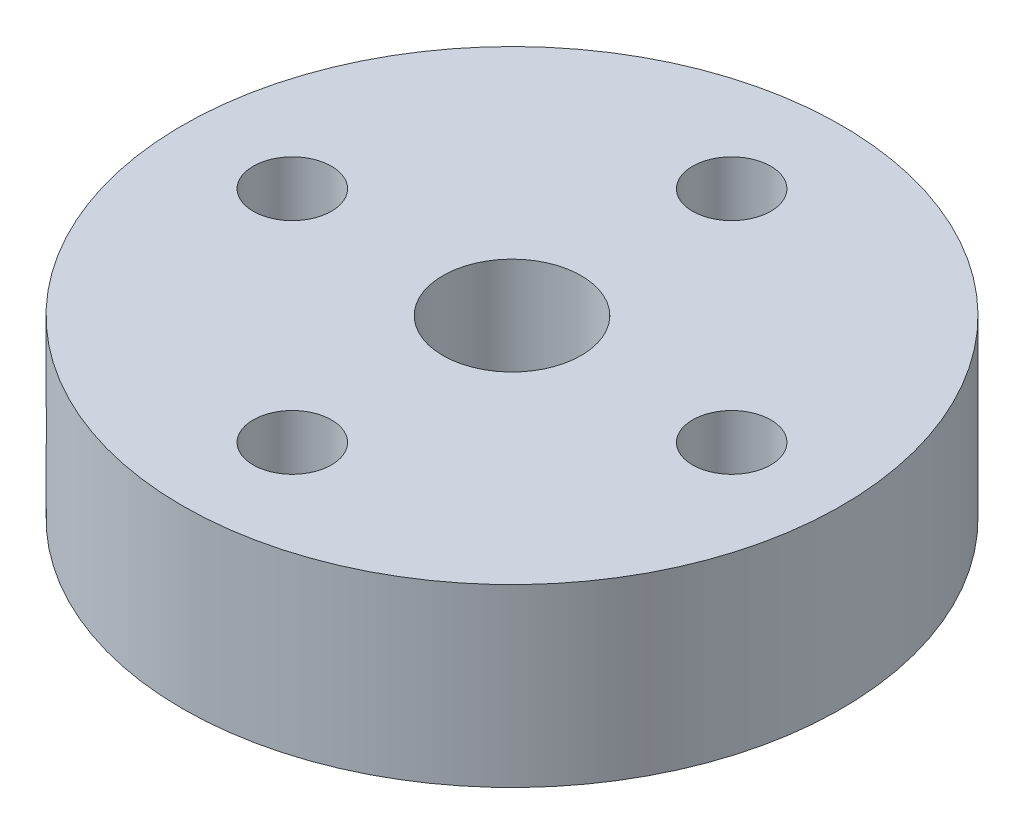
ISO-10303-21;
HEADER;
FILE_DESCRIPTION(('STEP AP214'),'2;1');
FILE_NAME('part.step','',(''),(''),'','','');
FILE_SCHEMA(('AUTOMOTIVE_DESIGN { 1 0 10303 214 1 1 1 1 }'));
ENDSEC;
DATA;
#1=APPLICATION_CONTEXT('core data for automotive mechanical design processes');
#2=APPLICATION_PROTOCOL_DEFINITION('international standard','automotive_design',2000,#1);
#3=PRODUCT_CONTEXT('',#1,'mechanical');
#4=PRODUCT('Part','Part','',(#3));
#5=PRODUCT_RELATED_PRODUCT_CATEGORY('part','',(#4));
#6=PRODUCT_DEFINITION_FORMATION('','',#4);
#7=PRODUCT_DEFINITION_CONTEXT('part definition',#1,'design');
#8=PRODUCT_DEFINITION('design','',#6,#7);
#9=PRODUCT_DEFINITION_SHAPE('','',#8);
#10=(LENGTH_UNIT() NAMED_UNIT(*) SI_UNIT(.MILLI.,.METRE.));
#11=(NAMED_UNIT(*) PLANE_ANGLE_UNIT() SI_UNIT($,.RADIAN.));
#12=(NAMED_UNIT(*) SI_UNIT($,.STERADIAN.) SOLID_ANGLE_UNIT());
#13=UNCERTAINTY_MEASURE_WITH_UNIT(LENGTH_MEASURE(1.E-05),#10,'distance_accuracy_value','');
#14=(GEOMETRIC_REPRESENTATION_CONTEXT(3) GLOBAL_UNCERTAINTY_ASSIGNED_CONTEXT((#13)) GLOBAL_UNIT_ASSIGNED_CONTEXT((#10,
#11,#12)) REPRESENTATION_CONTEXT('',''));
#15=CARTESIAN_POINT('',(0.,0.,0.));
#16=DIRECTION('',(0.,0.,1.));
#17=DIRECTION('',(1.,0.,0.));
#18=AXIS2_PLACEMENT_3D('',#15,#16,#17);
#19=CARTESIAN_POINT('',(0.,5.08,0.));
#20=DIRECTION('',(0.,1.,0.));
#21=DIRECTION('',(0.,0.,1.));
#22=AXIS2_PLACEMENT_3D('',#19,#20,#21);
#23=PLANE('',#22);
#24=CARTESIAN_POINT('',(0.,5.08,6.35));
#25=DIRECTION('',(0.,1.,0.));
#26=DIRECTION('',(0.,0.,1.));
#27=AXIS2_PLACEMENT_3D('',#24,#25,#26);
#28=CIRCLE('',#27,1.1303);
#29=CARTESIAN_POINT('',(0.,5.08,7.4803));
#30=VERTEX_POINT('',#29);
#31=EDGE_CURVE('E74',#30,#30,#28,.T.);
#32=ORIENTED_EDGE('',*,*,#31,.F.);
#33=EDGE_LOOP('',(#32));
#34=FACE_BOUND('',#33,.T.);
#35=CARTESIAN_POINT('',(0.,5.08,-6.35));
#36=DIRECTION('',(0.,1.,0.));
#37=DIRECTION('',(0.,0.,1.));
#38=AXIS2_PLACEMENT_3D('',#35,#36,#37);
#39=CIRCLE('',#38,1.1303);
#40=CARTESIAN_POINT('',(0.,5.08,-5.2197));
#41=VERTEX_POINT('',#40);
#42=EDGE_CURVE('E68',#41,#41,#39,.T.);
#43=ORIENTED_EDGE('',*,*,#42,.F.);
#44=EDGE_LOOP('',(#43));
#45=FACE_BOUND('',#44,.T.);
#46=CARTESIAN_POINT('',(-6.35,5.08,0.));
#47=DIRECTION('',(0.,1.,0.));
#48=DIRECTION('',(0.,0.,1.));
#49=AXIS2_PLACEMENT_3D('',#46,#47,#48);
#50=CIRCLE('',#49,1.1303);
#51=CARTESIAN_POINT('',(-6.35,5.08,1.1303));
#52=VERTEX_POINT('',#51);
#53=EDGE_CURVE('E62',#52,#52,#50,.T.);
#54=ORIENTED_EDGE('',*,*,#53,.F.);
#55=EDGE_LOOP('',(#54));
#56=FACE_BOUND('',#55,.T.);
#57=CARTESIAN_POINT('',(6.35,5.08,0.));
#58=DIRECTION('',(0.,1.,0.));
#59=DIRECTION('',(0.,0.,1.));
#60=AXIS2_PLACEMENT_3D('',#57,#58,#59);
#61=CIRCLE('',#60,1.1303);
#62=CARTESIAN_POINT('',(6.35,5.08,1.1303));
#63=VERTEX_POINT('',#62);
#64=EDGE_CURVE('E56',#63,#63,#61,.T.);
#65=ORIENTED_EDGE('',*,*,#64,.F.);
#66=EDGE_LOOP('',(#65));
#67=FACE_BOUND('',#66,.T.);
#68=CARTESIAN_POINT('',(0.,5.08,0.));
#69=DIRECTION('',(0.,1.,0.));
#70=DIRECTION('',(0.,0.,1.));
#71=AXIS2_PLACEMENT_3D('',#68,#69,#70);
#72=CIRCLE('',#71,9.525);
#73=CARTESIAN_POINT('',(0.,5.08,9.525));
#74=VERTEX_POINT('',#73);
#75=EDGE_CURVE('E10',#74,#74,#72,.T.);
#76=ORIENTED_EDGE('',*,*,#75,.T.);
#77=EDGE_LOOP('',(#76));
#78=FACE_BOUND('',#77,.T.);
#79=CARTESIAN_POINT('',(0.,5.08,0.));
#80=DIRECTION('',(0.,1.,0.));
#81=DIRECTION('',(0.,0.,1.));
#82=AXIS2_PLACEMENT_3D('',#79,#80,#81);
#83=CIRCLE('',#82,2.);
#84=CARTESIAN_POINT('',(0.,5.08,2.));
#85=VERTEX_POINT('',#84);
#86=EDGE_CURVE('E46',#85,#85,#83,.T.);
#87=ORIENTED_EDGE('',*,*,#86,.F.);
#88=EDGE_LOOP('',(#87));
#89=FACE_BOUND('',#88,.T.);
#90=ADVANCED_FACE('F34',(#34,#45,#56,#67,#78,#89),#23,.T.);
#91=CARTESIAN_POINT('',(0.,0.,0.));
#92=DIRECTION('',(0.,1.,0.));
#93=DIRECTION('',(0.,0.,1.));
#94=AXIS2_PLACEMENT_3D('',#91,#92,#93);
#95=PLANE('',#94);
#96=CARTESIAN_POINT('',(0.,0.,6.35));
#97=DIRECTION('',(0.,1.,0.));
#98=DIRECTION('',(0.,0.,1.));
#99=AXIS2_PLACEMENT_3D('',#96,#97,#98);
#100=CIRCLE('',#99,1.1303);
#101=CARTESIAN_POINT('',(0.,0.,7.4803));
#102=VERTEX_POINT('',#101);
#103=EDGE_CURVE('E71',#102,#102,#100,.T.);
#104=ORIENTED_EDGE('',*,*,#103,.T.);
#105=EDGE_LOOP('',(#104));
#106=FACE_BOUND('',#105,.T.);
#107=CARTESIAN_POINT('',(0.,0.,-6.35));
#108=DIRECTION('',(0.,1.,0.));
#109=DIRECTION('',(0.,0.,1.));
#110=AXIS2_PLACEMENT_3D('',#107,#108,#109);
#111=CIRCLE('',#110,1.1303);
#112=CARTESIAN_POINT('',(0.,0.,-5.2197));
#113=VERTEX_POINT('',#112);
#114=EDGE_CURVE('E65',#113,#113,#111,.T.);
#115=ORIENTED_EDGE('',*,*,#114,.T.);
#116=EDGE_LOOP('',(#115));
#117=FACE_BOUND('',#116,.T.);
#118=CARTESIAN_POINT('',(-6.35,0.,0.));
#119=DIRECTION('',(0.,1.,0.));
#120=DIRECTION('',(0.,0.,1.));
#121=AXIS2_PLACEMENT_3D('',#118,#119,#120);
#122=CIRCLE('',#121,1.1303);
#123=CARTESIAN_POINT('',(-6.35,0.,1.1303));
#124=VERTEX_POINT('',#123);
#125=EDGE_CURVE('E59',#124,#124,#122,.T.);
#126=ORIENTED_EDGE('',*,*,#125,.T.);
#127=EDGE_LOOP('',(#126));
#128=FACE_BOUND('',#127,.T.);
#129=CARTESIAN_POINT('',(6.35,0.,0.));
#130=DIRECTION('',(0.,1.,0.));
#131=DIRECTION('',(0.,0.,1.));
#132=AXIS2_PLACEMENT_3D('',#129,#130,#131);
#133=CIRCLE('',#132,1.1303);
#134=CARTESIAN_POINT('',(6.35,0.,1.1303));
#135=VERTEX_POINT('',#134);
#136=EDGE_CURVE('E51',#135,#135,#133,.T.);
#137=ORIENTED_EDGE('',*,*,#136,.T.);
#138=EDGE_LOOP('',(#137));
#139=FACE_BOUND('',#138,.T.);
#140=CARTESIAN_POINT('',(0.,0.,0.));
#141=DIRECTION('',(0.,1.,0.));
#142=DIRECTION('',(0.,0.,1.));
#143=AXIS2_PLACEMENT_3D('',#140,#141,#142);
#144=CIRCLE('',#143,9.525);
#145=CARTESIAN_POINT('',(0.,0.,9.525));
#146=VERTEX_POINT('',#145);
#147=EDGE_CURVE('E39',#146,#146,#144,.T.);
#148=ORIENTED_EDGE('',*,*,#147,.F.);
#149=EDGE_LOOP('',(#148));
#150=FACE_BOUND('',#149,.T.);
#151=CARTESIAN_POINT('',(0.,0.,0.));
#152=DIRECTION('',(0.,1.,0.));
#153=DIRECTION('',(0.,0.,1.));
#154=AXIS2_PLACEMENT_3D('',#151,#152,#153);
#155=CIRCLE('',#154,2.);
#156=CARTESIAN_POINT('',(0.,0.,2.));
#157=VERTEX_POINT('',#156);
#158=EDGE_CURVE('E48',#157,#157,#155,.T.);
#159=ORIENTED_EDGE('',*,*,#158,.T.);
#160=EDGE_LOOP('',(#159));
#161=FACE_BOUND('',#160,.T.);
#162=ADVANCED_FACE('F115',(#106,#117,#128,#139,#150,#161),#95,.F.);
#163=CARTESIAN_POINT('',(0.,5.08,0.));
#164=DIRECTION('',(0.,-1.,0.));
#165=DIRECTION('',(0.,0.,-1.));
#166=AXIS2_PLACEMENT_3D('',#163,#164,#165);
#167=CYLINDRICAL_SURFACE('',#166,9.525);
#168=CARTESIAN_POINT('',(-6.440566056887,2.54,7.01745921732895));
#169=CARTESIAN_POINT('',(-6.44056847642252,2.47675083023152,7.01745773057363));
#170=CARTESIAN_POINT('',(-6.44452205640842,2.41346150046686,7.01383477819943));
#171=CARTESIAN_POINT('',(-6.46019164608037,2.28864237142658,6.99940411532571));
#172=CARTESIAN_POINT('',(-6.47191588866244,2.22711451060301,6.98858878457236));
#173=CARTESIAN_POINT('',(-6.50265793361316,2.10764367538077,6.95999301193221));
#174=CARTESIAN_POINT('',(-6.52167093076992,2.04969836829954,6.94221715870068));
#175=CARTESIAN_POINT('',(-6.56625890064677,1.93898333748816,6.9000584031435));
#176=CARTESIAN_POINT('',(-6.59183270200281,1.8862126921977,6.87567668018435));
#177=CARTESIAN_POINT('',(-6.64873010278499,1.78706674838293,6.8206730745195));
#178=CARTESIAN_POINT('',(-6.68007913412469,1.74072139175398,6.7900235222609));
#179=CARTESIAN_POINT('',(-6.74733105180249,1.65600003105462,6.72319799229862));
#180=CARTESIAN_POINT('',(-6.78323415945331,1.61762441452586,6.6870217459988));
#181=CARTESIAN_POINT('',(-6.85847122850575,1.54982538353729,6.60983405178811));
#182=CARTESIAN_POINT('',(-6.89781507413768,1.52042892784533,6.56880854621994));
#183=CARTESIAN_POINT('',(-6.97852873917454,1.47159528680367,6.48299525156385));
#184=CARTESIAN_POINT('',(-7.01989849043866,1.45215776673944,6.43820758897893));
#185=CARTESIAN_POINT('',(-7.10314174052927,1.42388283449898,6.34624526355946));
#186=CARTESIAN_POINT('',(-7.14501193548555,1.41499577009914,6.29908287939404));
#187=CARTESIAN_POINT('',(-7.22818046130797,1.40792020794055,6.20347047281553));
#188=CARTESIAN_POINT('',(-7.26947881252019,1.40973132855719,6.15502049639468));
#189=CARTESIAN_POINT('',(-7.35012872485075,1.42396079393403,6.05847922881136));
#190=CARTESIAN_POINT('',(-7.38948903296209,1.43632574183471,6.01038735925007));
#191=CARTESIAN_POINT('',(-7.46546537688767,1.47122847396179,5.91575323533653));
#192=CARTESIAN_POINT('',(-7.50208136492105,1.49376643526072,5.86921100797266));
#193=CARTESIAN_POINT('',(-7.57179079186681,1.54843268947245,5.77900251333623));
#194=CARTESIAN_POINT('',(-7.60487542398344,1.5805842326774,5.73534353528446));
#195=CARTESIAN_POINT('',(-7.66671410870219,1.65354808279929,5.65241538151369));
#196=CARTESIAN_POINT('',(-7.69546798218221,1.694360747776,5.61314638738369));
#197=CARTESIAN_POINT('',(-7.74825069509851,1.7837877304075,5.5400618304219));
#198=CARTESIAN_POINT('',(-7.77224933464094,1.83244856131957,5.50628135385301));
#199=CARTESIAN_POINT('',(-7.8148661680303,1.93603038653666,5.44562853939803));
#200=CARTESIAN_POINT('',(-7.83348434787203,1.99095139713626,5.41875621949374));
#201=CARTESIAN_POINT('',(-7.86503014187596,2.1055342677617,5.37286751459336));
#202=CARTESIAN_POINT('',(-7.8779557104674,2.16519782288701,5.35385395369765));
#203=CARTESIAN_POINT('',(-7.89789354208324,2.28755178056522,5.32439872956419));
#204=CARTESIAN_POINT('',(-7.90490606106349,2.35024205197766,5.31395669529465));
#205=CARTESIAN_POINT('',(-7.9128808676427,2.47646170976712,5.30207442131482));
#206=CARTESIAN_POINT('',(-7.91387969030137,2.53998367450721,5.3005798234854));
#207=CARTESIAN_POINT('',(-7.9099088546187,2.66642145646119,5.30650347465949));
#208=CARTESIAN_POINT('',(-7.90493931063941,2.72933728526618,5.31392155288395));
#209=CARTESIAN_POINT('',(-7.88913528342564,2.85258339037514,5.33735572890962));
#210=CARTESIAN_POINT('',(-7.8783185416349,2.91292089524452,5.35334581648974));
#211=CARTESIAN_POINT('',(-7.85100484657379,3.02952333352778,5.3933227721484));
#212=CARTESIAN_POINT('',(-7.83450771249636,3.08578813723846,5.41730989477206));
#213=CARTESIAN_POINT('',(-7.79601228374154,3.19294290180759,5.47256359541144));
#214=CARTESIAN_POINT('',(-7.77398812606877,3.24380594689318,5.50386434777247));
#215=CARTESIAN_POINT('',(-7.72486206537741,3.33843921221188,5.5726036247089));
#216=CARTESIAN_POINT('',(-7.69775998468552,3.38220918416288,5.61004236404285));
#217=CARTESIAN_POINT('',(-7.63883631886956,3.46164117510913,5.69001577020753));
#218=CARTESIAN_POINT('',(-7.60699128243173,3.49726053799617,5.73257554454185));
#219=CARTESIAN_POINT('',(-7.53935127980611,3.55908550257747,5.82124663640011));
#220=CARTESIAN_POINT('',(-7.50355638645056,3.58529127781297,5.86735788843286));
#221=CARTESIAN_POINT('',(-7.42893789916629,3.62747423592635,5.96155222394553));
#222=CARTESIAN_POINT('',(-7.39012195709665,3.64347637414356,6.00963018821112));
#223=CARTESIAN_POINT('',(-7.31037526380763,3.66487907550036,6.10638736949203));
#224=CARTESIAN_POINT('',(-7.26944459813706,3.67028006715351,6.15506656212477));
#225=CARTESIAN_POINT('',(-7.18686061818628,3.67031970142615,6.25129227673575));
#226=CARTESIAN_POINT('',(-7.14521328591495,3.66502423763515,6.29884391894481));
#227=CARTESIAN_POINT('',(-7.06217749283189,3.6439604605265,6.39180410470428));
#228=CARTESIAN_POINT('',(-7.02078903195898,3.62819214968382,6.43721264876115));
#229=CARTESIAN_POINT('',(-6.9395661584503,3.58665033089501,6.52469241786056));
#230=CARTESIAN_POINT('',(-6.8997313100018,3.56087965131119,6.56676458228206));
#231=CARTESIAN_POINT('',(-6.82288993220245,3.50007146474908,6.64656831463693));
#232=CARTESIAN_POINT('',(-6.78588342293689,3.46503389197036,6.68429985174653));
#233=CARTESIAN_POINT('',(-6.71573191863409,3.38644164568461,6.7547805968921));
#234=CARTESIAN_POINT('',(-6.68261101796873,3.34283789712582,6.78749906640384));
#235=CARTESIAN_POINT('',(-6.62164533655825,3.24845211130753,6.84698892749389));
#236=CARTESIAN_POINT('',(-6.59380181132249,3.19766837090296,6.87375890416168));
#237=CARTESIAN_POINT('',(-6.54433510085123,3.09016285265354,6.92087260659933));
#238=CARTESIAN_POINT('',(-6.52273395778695,3.03342097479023,6.941193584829));
#239=CARTESIAN_POINT('',(-6.48673100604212,2.91578612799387,6.97485187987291));
#240=CARTESIAN_POINT('',(-6.47232128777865,2.85489780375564,6.98819687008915));
#241=CARTESIAN_POINT('',(-6.45474957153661,2.75140489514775,7.0044214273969));
#242=CARTESIAN_POINT('',(-6.44944055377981,2.70945572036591,7.0093056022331));
#243=CARTESIAN_POINT('',(-6.44234799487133,2.62501040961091,7.01582498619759));
#244=CARTESIAN_POINT('',(-6.44056443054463,2.58251427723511,7.01746021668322));
#245=CARTESIAN_POINT('',(-6.440566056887,2.54,7.01745921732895));
#246=B_SPLINE_CURVE_WITH_KNOTS('',3,(#168,#169,#170,#171,#172,#173,#174,#175,#176,#177,#178,
#179,#180,#181,#182,#183,#184,#185,#186,#187,#188,#189,#190,#191,#192,#193,#194,#195,#196,#197,
#198,#199,#200,#201,#202,#203,#204,#205,#206,#207,#208,#209,#210,#211,#212,#213,#214,#215,#216,
#217,#218,#219,#220,#221,#222,#223,#224,#225,#226,#227,#228,#229,#230,#231,#232,#233,#234,#235,
#236,#237,#238,#239,#240,#241,#242,#243,#244,#245),.UNSPECIFIED.,.T.,.F.,(4,2,2,2,2,2,2,2,2,2,2,
2,2,2,2,2,2,2,2,2,2,2,2,2,2,2,2,2,2,2,2,2,2,2,2,2,2,2,4),(0.,0.189592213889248,
0.379385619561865,0.569054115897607,0.758688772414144,0.949179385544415,1.13967925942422,
1.33074558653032,1.52180549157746,1.71196262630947,1.90211297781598,2.09130693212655,
2.2805041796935,2.47016275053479,2.65982916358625,2.85066401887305,3.04149937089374,
3.2324032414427,3.42329884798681,3.61303352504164,3.80276456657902,3.99192313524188,
4.18108772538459,4.37115455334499,4.56122803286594,4.75227459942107,4.94331764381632,
5.13389163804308,5.32445792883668,5.51385385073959,5.70324972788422,5.89259208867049,
6.08193579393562,6.27239765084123,6.4629047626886,6.6540765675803,6.84503764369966,
6.97247692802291,7.09991537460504),.UNSPECIFIED.);
#247=CARTESIAN_POINT('',(-6.440566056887,2.54,7.01745921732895));
#248=VERTEX_POINT('',#247);
#249=EDGE_CURVE('E77',#248,#248,#246,.T.);
#250=ORIENTED_EDGE('',*,*,#249,.T.);
#251=EDGE_LOOP('',(#250));
#252=FACE_BOUND('',#251,.T.);
#253=ORIENTED_EDGE('',*,*,#75,.F.);
#254=EDGE_LOOP('',(#253));
#255=FACE_BOUND('',#254,.T.);
#256=ORIENTED_EDGE('',*,*,#147,.T.);
#257=EDGE_LOOP('',(#256));
#258=FACE_BOUND('',#257,.T.);
#259=ADVANCED_FACE('F36',(#252,#255,#258),#167,.T.);
#260=CARTESIAN_POINT('',(0.,5.08,0.));
#261=DIRECTION('',(0.,-1.,0.));
#262=DIRECTION('',(0.,0.,-1.));
#263=AXIS2_PLACEMENT_3D('',#260,#261,#262);
#264=CYLINDRICAL_SURFACE('',#263,2.);
#265=CARTESIAN_POINT('',(-0.515881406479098,2.54,1.9323214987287));
#266=CARTESIAN_POINT('',(-0.515884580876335,2.48235721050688,1.93232188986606));
#267=CARTESIAN_POINT('',(-0.521098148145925,2.42470129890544,1.93095153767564));
#268=CARTESIAN_POINT('',(-0.541384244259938,2.31127590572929,1.92535902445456));
#269=CARTESIAN_POINT('',(-0.556467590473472,2.25550856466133,1.92113373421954));
#270=CARTESIAN_POINT('',(-0.594943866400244,2.14771379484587,1.90956486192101));
#271=CARTESIAN_POINT('',(-0.618283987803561,2.09566506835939,1.90224104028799));
#272=CARTESIAN_POINT('',(-0.671646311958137,1.99580784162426,1.88406056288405));
#273=CARTESIAN_POINT('',(-0.701670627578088,1.94800068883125,1.87320278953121));
#274=CARTESIAN_POINT('',(-0.770359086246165,1.85235593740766,1.84609044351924));
#275=CARTESIAN_POINT('',(-0.809604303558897,1.80506409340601,1.82938222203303));
#276=CARTESIAN_POINT('',(-0.892556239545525,1.71712247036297,1.79037598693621));
#277=CARTESIAN_POINT('',(-0.936265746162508,1.67647688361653,1.76807446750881));
#278=CARTESIAN_POINT('',(-1.03057876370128,1.59928818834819,1.7149622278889));
#279=CARTESIAN_POINT('',(-1.08144638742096,1.56346832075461,1.68355674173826));
#280=CARTESIAN_POINT('',(-1.18406880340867,1.50217536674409,1.61302344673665));
#281=CARTESIAN_POINT('',(-1.23582284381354,1.47669392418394,1.57390191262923));
#282=CARTESIAN_POINT('',(-1.33326114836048,1.43914233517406,1.49201405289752));
#283=CARTESIAN_POINT('',(-1.37908212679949,1.42609940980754,1.44985961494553));
#284=CARTESIAN_POINT('',(-1.46736984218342,1.41053750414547,1.36042706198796));
#285=CARTESIAN_POINT('',(-1.50983925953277,1.40801002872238,1.31315311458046));
#286=CARTESIAN_POINT('',(-1.58535034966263,1.41330243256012,1.22058870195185));
#287=CARTESIAN_POINT('',(-1.61891522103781,1.42001083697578,1.17565538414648));
#288=CARTESIAN_POINT('',(-1.68134703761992,1.44151793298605,1.08449262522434));
#289=CARTESIAN_POINT('',(-1.71021363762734,1.45631721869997,1.03826308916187));
#290=CARTESIAN_POINT('',(-1.76319177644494,1.49354831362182,0.945535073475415));
#291=CARTESIAN_POINT('',(-1.78725568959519,1.51605108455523,0.899038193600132));
#292=CARTESIAN_POINT('',(-1.83040259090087,1.56788094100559,0.807580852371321));
#293=CARTESIAN_POINT('',(-1.84948407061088,1.59721008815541,0.762620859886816));
#294=CARTESIAN_POINT('',(-1.88493625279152,1.66557489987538,0.670603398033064));
#295=CARTESIAN_POINT('',(-1.90076714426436,1.70532836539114,0.623871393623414));
#296=CARTESIAN_POINT('',(-1.92756255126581,1.79154578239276,0.535392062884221));
#297=CARTESIAN_POINT('',(-1.93852127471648,1.83801763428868,0.493650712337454));
#298=CARTESIAN_POINT('',(-1.95732995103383,1.94170265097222,0.413188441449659));
#299=CARTESIAN_POINT('',(-1.96477952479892,1.9995190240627,0.37514416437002));
#300=CARTESIAN_POINT('',(-1.97614574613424,2.12121679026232,0.309770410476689));
#301=CARTESIAN_POINT('',(-1.98006858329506,2.18508733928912,0.282422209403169));
#302=CARTESIAN_POINT('',(-1.98491103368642,2.3022859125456,0.245742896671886));
#303=CARTESIAN_POINT('',(-1.98630722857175,2.35476062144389,0.233744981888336));
#304=CARTESIAN_POINT('',(-1.98801699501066,2.46098259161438,0.218744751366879));
#305=CARTESIAN_POINT('',(-1.98833156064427,2.51472863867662,0.215734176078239));
#306=CARTESIAN_POINT('',(-1.98797719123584,2.62195410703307,0.218971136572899));
#307=CARTESIAN_POINT('',(-1.98730781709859,2.67543339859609,0.225222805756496));
#308=CARTESIAN_POINT('',(-1.9847870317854,2.78061364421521,0.246436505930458));
#309=CARTESIAN_POINT('',(-1.98293477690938,2.83231330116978,0.261404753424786));
#310=CARTESIAN_POINT('',(-1.977583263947,2.9335103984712,0.299217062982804));
#311=CARTESIAN_POINT('',(-1.97405962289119,2.98296294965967,0.322176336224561));
#312=CARTESIAN_POINT('',(-1.96478912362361,3.07806088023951,0.37458083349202));
#313=CARTESIAN_POINT('',(-1.95904134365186,3.12370467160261,0.404028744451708));
#314=CARTESIAN_POINT('',(-1.94354237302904,3.21775291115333,0.473392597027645));
#315=CARTESIAN_POINT('',(-1.93329148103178,3.26539544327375,0.514232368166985));
#316=CARTESIAN_POINT('',(-1.90801727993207,3.35411733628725,0.601270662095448));
#317=CARTESIAN_POINT('',(-1.89299016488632,3.39519142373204,0.647473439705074));
#318=CARTESIAN_POINT('',(-1.85564753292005,3.47343442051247,0.748140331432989));
#319=CARTESIAN_POINT('',(-1.83278021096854,3.50987467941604,0.802972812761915));
#320=CARTESIAN_POINT('',(-1.77957667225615,3.57249838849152,0.914839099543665));
#321=CARTESIAN_POINT('',(-1.74924651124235,3.59869011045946,0.971871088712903));
#322=CARTESIAN_POINT('',(-1.68384992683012,3.63776441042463,1.08090236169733));
#323=CARTESIAN_POINT('',(-1.64938205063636,3.65156798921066,1.13292805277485));
#324=CARTESIAN_POINT('',(-1.57475047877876,3.66858448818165,1.23455361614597));
#325=CARTESIAN_POINT('',(-1.53459157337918,3.67180626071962,1.28415548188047));
#326=CARTESIAN_POINT('',(-1.4547522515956,3.66772533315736,1.37363914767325));
#327=CARTESIAN_POINT('',(-1.41552782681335,3.66156764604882,1.41398641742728));
#328=CARTESIAN_POINT('',(-1.33498501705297,3.64109388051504,1.49026548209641));
#329=CARTESIAN_POINT('',(-1.29366650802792,3.62677731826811,1.52619701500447));
#330=CARTESIAN_POINT('',(-1.2101364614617,3.59051840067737,1.5932533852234));
#331=CARTESIAN_POINT('',(-1.16792148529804,3.56853817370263,1.62435322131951));
#332=CARTESIAN_POINT('',(-1.08416432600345,3.51773403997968,1.68141590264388));
#333=CARTESIAN_POINT('',(-1.04262233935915,3.48890817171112,1.70737727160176));
#334=CARTESIAN_POINT('',(-0.957031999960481,3.42164679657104,1.75692767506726));
#335=CARTESIAN_POINT('',(-0.913208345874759,3.38250414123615,1.77994437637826));
#336=CARTESIAN_POINT('',(-0.829603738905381,3.29751187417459,1.82041755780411));
#337=CARTESIAN_POINT('',(-0.789827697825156,3.25165427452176,1.83786733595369));
#338=CARTESIAN_POINT('',(-0.712462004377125,3.14909677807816,1.86930691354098));
#339=CARTESIAN_POINT('',(-0.675483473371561,3.09177211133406,1.88277983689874));
#340=CARTESIAN_POINT('',(-0.611376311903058,2.97099110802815,1.90456644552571));
#341=CARTESIAN_POINT('',(-0.584229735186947,2.9075462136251,1.91288955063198));
#342=CARTESIAN_POINT('',(-0.547987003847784,2.79325736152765,1.92353025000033));
#343=CARTESIAN_POINT('',(-0.536036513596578,2.74340721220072,1.92684507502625));
#344=CARTESIAN_POINT('',(-0.519985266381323,2.64237413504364,1.93123968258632));
#345=CARTESIAN_POINT('',(-0.515878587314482,2.59119224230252,1.93232115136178));
#346=CARTESIAN_POINT('',(-0.515881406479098,2.54,1.9323214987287));
#347=B_SPLINE_CURVE_WITH_KNOTS('',3,(#265,#266,#267,#268,#269,#270,#271,#272,#273,#274,#275,
#276,#277,#278,#279,#280,#281,#282,#283,#284,#285,#286,#287,#288,#289,#290,#291,#292,#293,#294,
#295,#296,#297,#298,#299,#300,#301,#302,#303,#304,#305,#306,#307,#308,#309,#310,#311,#312,#313,
#314,#315,#316,#317,#318,#319,#320,#321,#322,#323,#324,#325,#326,#327,#328,#329,#330,#331,#332,
#333,#334,#335,#336,#337,#338,#339,#340,#341,#342,#343,#344,#345,#346),.UNSPECIFIED.,.T.,.F.,(4,
2,2,2,2,2,2,2,2,2,2,2,2,2,2,2,2,2,2,2,2,2,2,2,2,2,2,2,2,2,2,2,2,2,2,2,2,2,2,2,4),(0.,
0.17271454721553,0.345618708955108,0.517436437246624,0.689308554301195,0.879599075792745,
1.07000916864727,1.27796638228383,1.4857551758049,1.67549260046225,1.86507671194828,
2.03373205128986,2.20239977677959,2.37266499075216,2.54298169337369,2.73229686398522,
2.92183649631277,3.12960615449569,3.33701045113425,3.49784081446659,3.65852332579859,
3.81927756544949,3.98014659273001,4.14343822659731,4.30679760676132,4.49677368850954,
4.68690153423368,4.89487903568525,5.10268832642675,5.2933241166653,5.48380038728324,
5.65281337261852,5.8218363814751,5.99170677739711,6.16162590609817,6.35017814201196,
6.53895652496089,6.74651430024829,6.95369128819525,7.10719406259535,7.26058089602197),.UNSPECIFIED.);
#348=CARTESIAN_POINT('',(-0.515881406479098,2.54,1.9323214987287));
#349=VERTEX_POINT('',#348);
#350=EDGE_CURVE('E83',#349,#349,#347,.T.);
#351=ORIENTED_EDGE('',*,*,#350,.F.);
#352=EDGE_LOOP('',(#351));
#353=FACE_BOUND('',#352,.T.);
#354=ORIENTED_EDGE('',*,*,#86,.T.);
#355=EDGE_LOOP('',(#354));
#356=FACE_BOUND('',#355,.T.);
#357=ORIENTED_EDGE('',*,*,#158,.F.);
#358=EDGE_LOOP('',(#357));
#359=FACE_BOUND('',#358,.T.);
#360=ADVANCED_FACE('F109',(#353,#356,#359),#264,.F.);
#361=CARTESIAN_POINT('',(6.35,5.08,0.));
#362=DIRECTION('',(0.,1.,0.));
#363=DIRECTION('',(0.,0.,1.));
#364=AXIS2_PLACEMENT_3D('',#361,#362,#363);
#365=CYLINDRICAL_SURFACE('',#364,1.1303);
#366=ORIENTED_EDGE('',*,*,#136,.F.);
#367=EDGE_LOOP('',(#366));
#368=FACE_BOUND('',#367,.T.);
#369=ORIENTED_EDGE('',*,*,#64,.T.);
#370=EDGE_LOOP('',(#369));
#371=FACE_BOUND('',#370,.T.);
#372=ADVANCED_FACE('F105',(#368,#371),#365,.F.);
#373=CARTESIAN_POINT('',(-6.35,5.08,0.));
#374=DIRECTION('',(0.,1.,0.));
#375=DIRECTION('',(0.,0.,1.));
#376=AXIS2_PLACEMENT_3D('',#373,#374,#375);
#377=CYLINDRICAL_SURFACE('',#376,1.1303);
#378=ORIENTED_EDGE('',*,*,#125,.F.);
#379=EDGE_LOOP('',(#378));
#380=FACE_BOUND('',#379,.T.);
#381=ORIENTED_EDGE('',*,*,#53,.T.);
#382=EDGE_LOOP('',(#381));
#383=FACE_BOUND('',#382,.T.);
#384=ADVANCED_FACE('F101',(#380,#383),#377,.F.);
#385=CARTESIAN_POINT('',(0.,5.08,-6.35));
#386=DIRECTION('',(0.,1.,0.));
#387=DIRECTION('',(0.,0.,1.));
#388=AXIS2_PLACEMENT_3D('',#385,#386,#387);
#389=CYLINDRICAL_SURFACE('',#388,1.1303);
#390=ORIENTED_EDGE('',*,*,#114,.F.);
#391=EDGE_LOOP('',(#390));
#392=FACE_BOUND('',#391,.T.);
#393=ORIENTED_EDGE('',*,*,#42,.T.);
#394=EDGE_LOOP('',(#393));
#395=FACE_BOUND('',#394,.T.);
#396=ADVANCED_FACE('F97',(#392,#395),#389,.F.);
#397=CARTESIAN_POINT('',(0.,5.08,6.35));
#398=DIRECTION('',(0.,1.,0.));
#399=DIRECTION('',(0.,0.,1.));
#400=AXIS2_PLACEMENT_3D('',#397,#398,#399);
#401=CYLINDRICAL_SURFACE('',#400,1.1303);
#402=ORIENTED_EDGE('',*,*,#103,.F.);
#403=EDGE_LOOP('',(#402));
#404=FACE_BOUND('',#403,.T.);
#405=ORIENTED_EDGE('',*,*,#31,.T.);
#406=EDGE_LOOP('',(#405));
#407=FACE_BOUND('',#406,.T.);
#408=ADVANCED_FACE('F90',(#404,#407),#401,.F.);
#409=CARTESIAN_POINT('',(-7.22779646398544,2.54,6.20359438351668));
#410=DIRECTION('',(-0.758823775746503,0.,0.651295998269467));
#411=DIRECTION('',(0.651295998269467,0.,0.758823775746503));
#412=AXIS2_PLACEMENT_3D('',#409,#410,#411);
#413=CYLINDRICAL_SURFACE('',#412,1.13029999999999);
#414=ORIENTED_EDGE('',*,*,#350,.T.);
#415=EDGE_LOOP('',(#414));
#416=FACE_BOUND('',#415,.T.);
#417=ORIENTED_EDGE('',*,*,#249,.F.);
#418=EDGE_LOOP('',(#417));
#419=FACE_BOUND('',#418,.T.);
#420=ADVANCED_FACE('F87',(#416,#419),#413,.F.);
#421=CLOSED_SHELL('',(#90,#162,#259,#360,#372,#384,#396,#408,#420));
#422=MANIFOLD_SOLID_BREP('B2',#421);
#423=ADVANCED_BREP_SHAPE_REPRESENTATION('',(#18,#422),#14);
#424=SHAPE_DEFINITION_REPRESENTATION(#9,#423);
ENDSEC;
END-ISO-10303-21;
